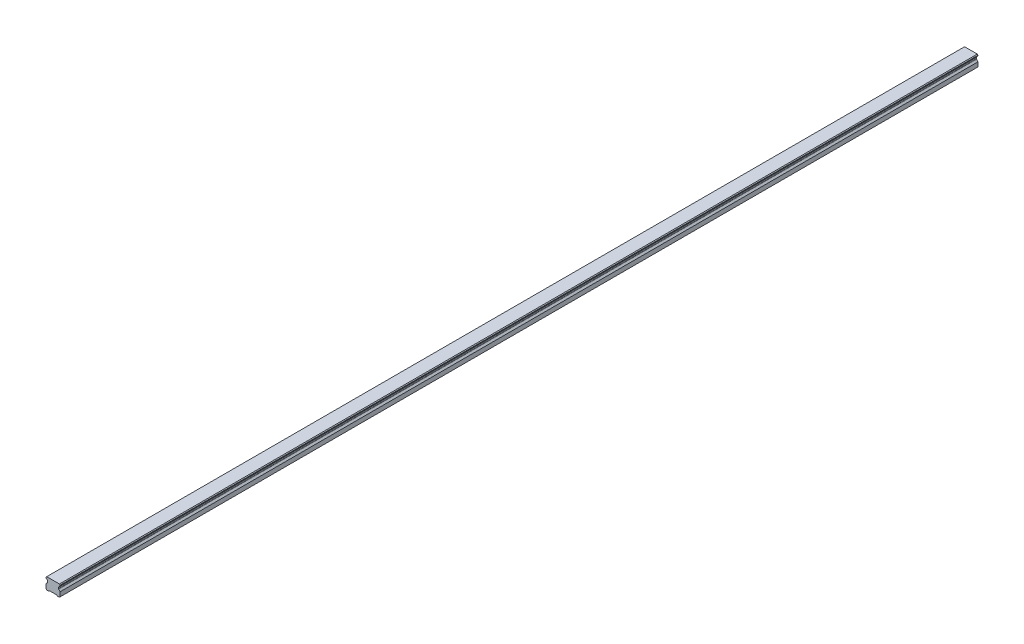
from build123d import *

# Parameters (mm, degrees)
SKETCH1_W           = 20
SKETCH1_H           = 16.3
BOSS_EXTRUDE1_DEPTH = 650
CUT_EXTRUDE1_DEPTH  = 1301.140642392
CHAMFER1_SIZE       = 1
FILLET1_R           = 1
CUT_EXTRUDE2_DEPTH  = 1301.140642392
SKETCH5_R           = 3
SKETCH5_R_2         = 2.5
CUT_EXTRUDE5_DEPTH  = 10
SKETCH5_2_R         = 2.5
CUT_EXTRUDE6_DEPTH  = 13
LPATTERN2_COUNT     = 22
LPATTERN2_PITCH     = 60


with BuildPart() as part:
    # Sketch1 → Boss-Extrude1 (new, symmetric)
    with BuildSketch(Plane.XY):
        with Locations((0, 8.15)):
            Rectangle(SKETCH1_W, SKETCH1_H)
    extrude(amount=BOSS_EXTRUDE1_DEPTH, both=True)

    # Sketch2 → Cut-Extrude1 (cut, through all)
    with BuildSketch(Plane.XY.offset(650)):
        Polygon((-10, 14.3), (-10, 7.3), (-7.666666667, 9.633333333), (-7.666666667, 11.966666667), align=None)
        Polygon((7.666666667, 11.966666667), (10, 14.3), (10, 7.3), (7.666666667, 9.633333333), align=None)
    extrude(amount=-CUT_EXTRUDE1_DEPTH, mode=Mode.SUBTRACT)

    # Chamfer1
    chamfer1_edges = [part.edges().sort_by_distance(p)[0] for p in [
        (-10, 16.3, 0),
        (10, 16.3, 0),
        (10, 0, 0),
        (-10, 0, 0),
    ]]
    chamfer(chamfer1_edges, length=CHAMFER1_SIZE)

    # Fillet1
    fillet1_edges = [part.edges().sort_by_distance(p)[0] for p in [
        (-7.666666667, 11.966666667, 0),
        (-7.666666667, 9.633333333, 0),
        (7.666666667, 9.633333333, 0),
        (7.666666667, 11.966666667, 0),
    ]]
    fillet(fillet1_edges, radius=FILLET1_R)

    # Sketch3 → Cut-Extrude2 (cut, through all)
    with BuildSketch(Plane.XY.offset(650)):
        Polygon((-6, 0), (-5, 1), (5, 1), (6, 0), align=None)
    extrude(amount=-CUT_EXTRUDE2_DEPTH, mode=Mode.SUBTRACT)

    # Sketch5 → Cut-Extrude5 (cut)
    with BuildSketch(Plane.XZ.offset(-1)):
        with Locations(Location((0, 630, 0), (0, 0, 270))):
            Circle(SKETCH5_R)
        with Locations(Location((0, 630, 0), (0, 0, 270))):
            Circle(SKETCH5_R_2, mode=Mode.SUBTRACT)
    cut_extrude5 = extrude(amount=-CUT_EXTRUDE5_DEPTH, mode=Mode.SUBTRACT)

    # Sketch5_2 → Cut-Extrude6 (cut)
    with BuildSketch(Plane.XZ.offset(-1)):
        with Locations(Location((0, 630, 0), (0, 0, 270))):
            Circle(SKETCH5_2_R)
    cut_extrude6 = extrude(amount=-CUT_EXTRUDE6_DEPTH, mode=Mode.SUBTRACT)

    # Cut-Extrude7 cone 1 section (on through the dimple's axis) → Cut-Extrude7 (revolve, cut)
    with BuildSketch(Plane(origin=(0, 14, 630), x_dir=(0, 0, -1), z_dir=(1, 0, 0))):
        Polygon((0, 0), (2.5, 0), (0, 1.443375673), align=None)
    cut_extrude7 = revolve(axis=Axis((0, 14, 630), (0, 1, 0)), mode=Mode.SUBTRACT)

    # LPattern2: Cut-Extrude5, Cut-Extrude6, Cut-Extrude7 ×22
    with Locations(*[(0, 0, -i * LPATTERN2_PITCH) for i in range(1, LPATTERN2_COUNT)]):
        add(cut_extrude5, mode=Mode.SUBTRACT)
        add(cut_extrude6, mode=Mode.SUBTRACT)
        add(cut_extrude7, mode=Mode.SUBTRACT)


solid = part.part
